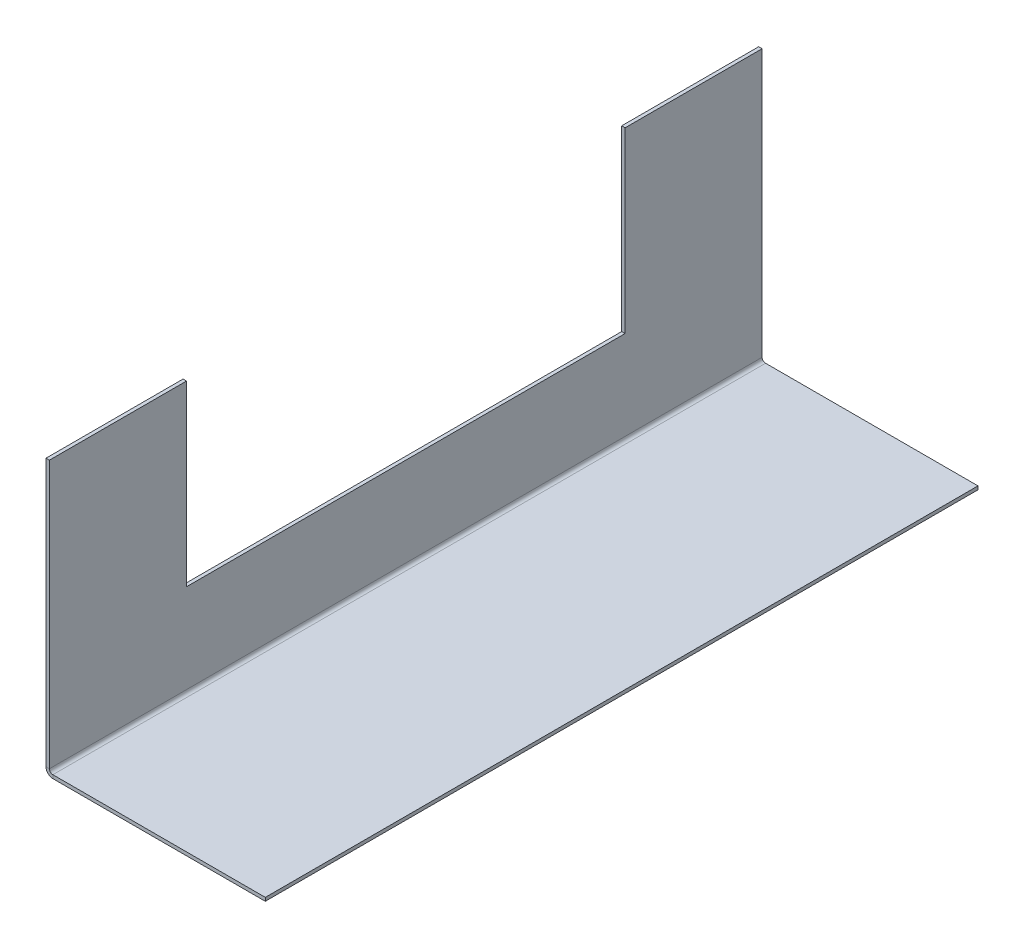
ISO-10303-21;
HEADER;
FILE_DESCRIPTION(('STEP AP214'),'2;1');
FILE_NAME('part.step','',(''),(''),'','','');
FILE_SCHEMA(('AUTOMOTIVE_DESIGN { 1 0 10303 214 1 1 1 1 }'));
ENDSEC;
DATA;
#1=APPLICATION_CONTEXT('core data for automotive mechanical design processes');
#2=APPLICATION_PROTOCOL_DEFINITION('international standard','automotive_design',2000,#1);
#3=PRODUCT_CONTEXT('',#1,'mechanical');
#4=PRODUCT('Part','Part','',(#3));
#5=PRODUCT_RELATED_PRODUCT_CATEGORY('part','',(#4));
#6=PRODUCT_DEFINITION_FORMATION('','',#4);
#7=PRODUCT_DEFINITION_CONTEXT('part definition',#1,'design');
#8=PRODUCT_DEFINITION('design','',#6,#7);
#9=PRODUCT_DEFINITION_SHAPE('','',#8);
#10=(LENGTH_UNIT() NAMED_UNIT(*) SI_UNIT(.MILLI.,.METRE.));
#11=(NAMED_UNIT(*) PLANE_ANGLE_UNIT() SI_UNIT($,.RADIAN.));
#12=(NAMED_UNIT(*) SI_UNIT($,.STERADIAN.) SOLID_ANGLE_UNIT());
#13=UNCERTAINTY_MEASURE_WITH_UNIT(LENGTH_MEASURE(1.E-05),#10,'distance_accuracy_value','');
#14=(GEOMETRIC_REPRESENTATION_CONTEXT(3) GLOBAL_UNCERTAINTY_ASSIGNED_CONTEXT((#13)) GLOBAL_UNIT_ASSIGNED_CONTEXT((#10,
#11,#12)) REPRESENTATION_CONTEXT('',''));
#15=CARTESIAN_POINT('',(0.,0.,0.));
#16=DIRECTION('',(0.,0.,1.));
#17=DIRECTION('',(1.,0.,0.));
#18=AXIS2_PLACEMENT_3D('',#15,#16,#17);
#19=CARTESIAN_POINT('',(3.175,254.,-330.2));
#20=DIRECTION('',(0.,1.,0.));
#21=DIRECTION('',(0.,0.,1.));
#22=AXIS2_PLACEMENT_3D('',#19,#20,#21);
#23=PLANE('',#22);
#24=DIRECTION('',(1.,0.,0.));
#25=VECTOR('',#24,1.);
#26=CARTESIAN_POINT('',(0.,254.,-203.2));
#27=LINE('',#26,#25);
#28=CARTESIAN_POINT('',(0.,254.,-203.2));
#29=VERTEX_POINT('',#28);
#30=CARTESIAN_POINT('',(3.175,254.,-203.2));
#31=VERTEX_POINT('',#30);
#32=EDGE_CURVE('E129',#29,#31,#27,.T.);
#33=ORIENTED_EDGE('',*,*,#32,.T.);
#34=DIRECTION('',(0.,0.,1.));
#35=VECTOR('',#34,1.);
#36=CARTESIAN_POINT('',(3.175,254.,-330.2));
#37=LINE('',#36,#35);
#38=CARTESIAN_POINT('',(3.175,254.,-330.2));
#39=VERTEX_POINT('',#38);
#40=EDGE_CURVE('E122',#39,#31,#37,.T.);
#41=ORIENTED_EDGE('',*,*,#40,.F.);
#42=DIRECTION('',(-1.,0.,0.));
#43=VECTOR('',#42,1.);
#44=CARTESIAN_POINT('',(3.175,254.,-330.2));
#45=LINE('',#44,#43);
#46=CARTESIAN_POINT('',(0.,254.,-330.2));
#47=VERTEX_POINT('',#46);
#48=EDGE_CURVE('E126',#39,#47,#45,.T.);
#49=ORIENTED_EDGE('',*,*,#48,.T.);
#50=DIRECTION('',(0.,0.,1.));
#51=VECTOR('',#50,1.);
#52=CARTESIAN_POINT('',(0.,254.,-330.2));
#53=LINE('',#52,#51);
#54=EDGE_CURVE('E182',#47,#29,#53,.T.);
#55=ORIENTED_EDGE('',*,*,#54,.T.);
#56=EDGE_LOOP('',(#33,#41,#49,#55));
#57=FACE_BOUND('',#56,.T.);
#58=ADVANCED_FACE('F40',(#57),#23,.T.);
#59=CARTESIAN_POINT('',(6.35,0.,-330.2));
#60=DIRECTION('',(0.,0.,-1.));
#61=DIRECTION('',(-1.,0.,0.));
#62=AXIS2_PLACEMENT_3D('',#59,#60,#61);
#63=PLANE('',#62);
#64=DIRECTION('',(0.,1.,0.));
#65=VECTOR('',#64,1.);
#66=CARTESIAN_POINT('',(6.35,0.,-330.2));
#67=LINE('',#66,#65);
#68=CARTESIAN_POINT('',(6.35,0.,-330.2));
#69=VERTEX_POINT('',#68);
#70=CARTESIAN_POINT('',(6.35,3.175,-330.2));
#71=VERTEX_POINT('',#70);
#72=EDGE_CURVE('E11',#69,#71,#67,.T.);
#73=ORIENTED_EDGE('',*,*,#72,.F.);
#74=CARTESIAN_POINT('',(6.35,6.35,-330.2));
#75=DIRECTION('',(0.,0.,-1.));
#76=DIRECTION('',(-1.,0.,0.));
#77=AXIS2_PLACEMENT_3D('',#74,#75,#76);
#78=CIRCLE('',#77,6.35);
#79=CARTESIAN_POINT('',(0.,6.35,-330.2));
#80=VERTEX_POINT('',#79);
#81=EDGE_CURVE('E151',#80,#69,#78,.F.);
#82=ORIENTED_EDGE('',*,*,#81,.F.);
#83=DIRECTION('',(-1.,0.,0.));
#84=VECTOR('',#83,1.);
#85=CARTESIAN_POINT('',(3.175,6.35,-330.2));
#86=LINE('',#85,#84);
#87=CARTESIAN_POINT('',(3.175,6.35,-330.2));
#88=VERTEX_POINT('',#87);
#89=EDGE_CURVE('E48',#88,#80,#86,.T.);
#90=ORIENTED_EDGE('',*,*,#89,.F.);
#91=CARTESIAN_POINT('',(6.35,6.35,-330.2));
#92=DIRECTION('',(0.,0.,-1.));
#93=DIRECTION('',(-1.,0.,0.));
#94=AXIS2_PLACEMENT_3D('',#91,#92,#93);
#95=CIRCLE('',#94,3.175);
#96=EDGE_CURVE('E144',#88,#71,#95,.F.);
#97=ORIENTED_EDGE('',*,*,#96,.T.);
#98=EDGE_LOOP('',(#73,#82,#90,#97));
#99=FACE_BOUND('',#98,.T.);
#100=ADVANCED_FACE('F42',(#99),#63,.T.);
#101=CARTESIAN_POINT('',(3.175,6.35,-330.2));
#102=DIRECTION('',(0.,0.,-1.));
#103=DIRECTION('',(-1.,0.,0.));
#104=AXIS2_PLACEMENT_3D('',#101,#102,#103);
#105=PLANE('',#104);
#106=DIRECTION('',(1.,0.,0.));
#107=VECTOR('',#106,1.);
#108=CARTESIAN_POINT('',(0.,0.,-330.2));
#109=LINE('',#108,#107);
#110=CARTESIAN_POINT('',(203.2,0.,-330.2));
#111=VERTEX_POINT('',#110);
#112=EDGE_CURVE('E206',#69,#111,#109,.T.);
#113=ORIENTED_EDGE('',*,*,#112,.F.);
#114=ORIENTED_EDGE('',*,*,#72,.T.);
#115=DIRECTION('',(1.,0.,0.));
#116=VECTOR('',#115,1.);
#117=CARTESIAN_POINT('',(0.,3.175,-330.2));
#118=LINE('',#117,#116);
#119=CARTESIAN_POINT('',(203.2,3.17499999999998,-330.2));
#120=VERTEX_POINT('',#119);
#121=EDGE_CURVE('E102',#71,#120,#118,.T.);
#122=ORIENTED_EDGE('',*,*,#121,.T.);
#123=DIRECTION('',(0.,1.,0.));
#124=VECTOR('',#123,1.);
#125=CARTESIAN_POINT('',(203.2,0.,-330.2));
#126=LINE('',#125,#124);
#127=EDGE_CURVE('E251',#111,#120,#126,.T.);
#128=ORIENTED_EDGE('',*,*,#127,.F.);
#129=EDGE_LOOP('',(#113,#114,#122,#128));
#130=FACE_BOUND('',#129,.T.);
#131=ADVANCED_FACE('F259',(#130),#105,.T.);
#132=CARTESIAN_POINT('',(0.,6.35,330.2));
#133=DIRECTION('',(0.,0.,1.));
#134=DIRECTION('',(1.,0.,0.));
#135=AXIS2_PLACEMENT_3D('',#132,#133,#134);
#136=PLANE('',#135);
#137=DIRECTION('',(1.,0.,0.));
#138=VECTOR('',#137,1.);
#139=CARTESIAN_POINT('',(0.,6.35,330.2));
#140=LINE('',#139,#138);
#141=CARTESIAN_POINT('',(0.,6.35,330.2));
#142=VERTEX_POINT('',#141);
#143=CARTESIAN_POINT('',(3.175,6.35,330.2));
#144=VERTEX_POINT('',#143);
#145=EDGE_CURVE('E195',#142,#144,#140,.T.);
#146=ORIENTED_EDGE('',*,*,#145,.F.);
#147=CARTESIAN_POINT('',(6.35,6.35,330.2));
#148=DIRECTION('',(0.,0.,-1.));
#149=DIRECTION('',(-1.,0.,0.));
#150=AXIS2_PLACEMENT_3D('',#147,#148,#149);
#151=CIRCLE('',#150,6.35);
#152=CARTESIAN_POINT('',(6.35,0.,330.2));
#153=VERTEX_POINT('',#152);
#154=EDGE_CURVE('E167',#142,#153,#151,.F.);
#155=ORIENTED_EDGE('',*,*,#154,.T.);
#156=DIRECTION('',(0.,-1.,0.));
#157=VECTOR('',#156,1.);
#158=CARTESIAN_POINT('',(6.35,3.175,330.2));
#159=LINE('',#158,#157);
#160=CARTESIAN_POINT('',(6.35,3.175,330.2));
#161=VERTEX_POINT('',#160);
#162=EDGE_CURVE('E96',#161,#153,#159,.T.);
#163=ORIENTED_EDGE('',*,*,#162,.F.);
#164=CARTESIAN_POINT('',(6.35,6.35,330.2));
#165=DIRECTION('',(0.,0.,-1.));
#166=DIRECTION('',(-1.,0.,0.));
#167=AXIS2_PLACEMENT_3D('',#164,#165,#166);
#168=CIRCLE('',#167,3.175);
#169=EDGE_CURVE('E177',#144,#161,#168,.F.);
#170=ORIENTED_EDGE('',*,*,#169,.F.);
#171=EDGE_LOOP('',(#146,#155,#163,#170));
#172=FACE_BOUND('',#171,.T.);
#173=ADVANCED_FACE('F265',(#172),#136,.T.);
#174=CARTESIAN_POINT('',(6.35,3.175,330.2));
#175=DIRECTION('',(0.,0.,1.));
#176=DIRECTION('',(1.,0.,0.));
#177=AXIS2_PLACEMENT_3D('',#174,#175,#176);
#178=PLANE('',#177);
#179=DIRECTION('',(0.,-1.,0.));
#180=VECTOR('',#179,1.);
#181=CARTESIAN_POINT('',(0.,0.,330.2));
#182=LINE('',#181,#180);
#183=CARTESIAN_POINT('',(0.,254.,330.2));
#184=VERTEX_POINT('',#183);
#185=EDGE_CURVE('E169',#184,#142,#182,.T.);
#186=ORIENTED_EDGE('',*,*,#185,.T.);
#187=ORIENTED_EDGE('',*,*,#145,.T.);
#188=DIRECTION('',(0.,1.,0.));
#189=VECTOR('',#188,1.);
#190=CARTESIAN_POINT('',(3.175,0.,330.2));
#191=LINE('',#190,#189);
#192=CARTESIAN_POINT('',(3.175,254.,330.2));
#193=VERTEX_POINT('',#192);
#194=EDGE_CURVE('E175',#193,#144,#191,.F.);
#195=ORIENTED_EDGE('',*,*,#194,.F.);
#196=DIRECTION('',(-1.,0.,0.));
#197=VECTOR('',#196,1.);
#198=CARTESIAN_POINT('',(3.175,254.,330.2));
#199=LINE('',#198,#197);
#200=EDGE_CURVE('E172',#193,#184,#199,.T.);
#201=ORIENTED_EDGE('',*,*,#200,.T.);
#202=EDGE_LOOP('',(#186,#187,#195,#201));
#203=FACE_BOUND('',#202,.T.);
#204=ADVANCED_FACE('F268',(#203),#178,.T.);
#205=CARTESIAN_POINT('',(0.,3.175,-330.2));
#206=DIRECTION('',(0.,-1.,0.));
#207=DIRECTION('',(1.,0.,0.));
#208=AXIS2_PLACEMENT_3D('',#205,#206,#207);
#209=PLANE('',#208);
#210=DIRECTION('',(1.,0.,0.));
#211=VECTOR('',#210,1.);
#212=CARTESIAN_POINT('',(0.,3.175,330.2));
#213=LINE('',#212,#211);
#214=CARTESIAN_POINT('',(203.2,3.17499999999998,330.2));
#215=VERTEX_POINT('',#214);
#216=EDGE_CURVE('E157',#161,#215,#213,.T.);
#217=ORIENTED_EDGE('',*,*,#216,.T.);
#218=DIRECTION('',(0.,0.,1.));
#219=VECTOR('',#218,1.);
#220=CARTESIAN_POINT('',(203.2,3.17499999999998,-330.2));
#221=LINE('',#220,#219);
#222=EDGE_CURVE('E192',#120,#215,#221,.T.);
#223=ORIENTED_EDGE('',*,*,#222,.F.);
#224=ORIENTED_EDGE('',*,*,#121,.F.);
#225=DIRECTION('',(0.,0.,1.));
#226=VECTOR('',#225,1.);
#227=CARTESIAN_POINT('',(6.35,3.175,-330.2));
#228=LINE('',#227,#226);
#229=EDGE_CURVE('E156',#71,#161,#228,.T.);
#230=ORIENTED_EDGE('',*,*,#229,.T.);
#231=EDGE_LOOP('',(#217,#223,#224,#230));
#232=FACE_BOUND('',#231,.T.);
#233=ADVANCED_FACE('F274',(#232),#209,.F.);
#234=CARTESIAN_POINT('',(203.2,0.,-330.2));
#235=DIRECTION('',(1.,0.,0.));
#236=DIRECTION('',(0.,0.,-1.));
#237=AXIS2_PLACEMENT_3D('',#234,#235,#236);
#238=PLANE('',#237);
#239=DIRECTION('',(0.,1.,0.));
#240=VECTOR('',#239,1.);
#241=CARTESIAN_POINT('',(203.2,0.,330.2));
#242=LINE('',#241,#240);
#243=CARTESIAN_POINT('',(203.2,0.,330.2));
#244=VERTEX_POINT('',#243);
#245=EDGE_CURVE('E160',#244,#215,#242,.T.);
#246=ORIENTED_EDGE('',*,*,#245,.F.);
#247=DIRECTION('',(0.,0.,1.));
#248=VECTOR('',#247,1.);
#249=CARTESIAN_POINT('',(203.2,0.,-330.2));
#250=LINE('',#249,#248);
#251=EDGE_CURVE('E190',#111,#244,#250,.T.);
#252=ORIENTED_EDGE('',*,*,#251,.F.);
#253=ORIENTED_EDGE('',*,*,#127,.T.);
#254=ORIENTED_EDGE('',*,*,#222,.T.);
#255=EDGE_LOOP('',(#246,#252,#253,#254));
#256=FACE_BOUND('',#255,.T.);
#257=ADVANCED_FACE('F261',(#256),#238,.T.);
#258=CARTESIAN_POINT('',(0.,0.,-330.2));
#259=DIRECTION('',(0.,-1.,0.));
#260=DIRECTION('',(1.,0.,0.));
#261=AXIS2_PLACEMENT_3D('',#258,#259,#260);
#262=PLANE('',#261);
#263=DIRECTION('',(1.,0.,0.));
#264=VECTOR('',#263,1.);
#265=CARTESIAN_POINT('',(0.,0.,330.2));
#266=LINE('',#265,#264);
#267=EDGE_CURVE('E164',#153,#244,#266,.T.);
#268=ORIENTED_EDGE('',*,*,#267,.F.);
#269=DIRECTION('',(0.,0.,1.));
#270=VECTOR('',#269,1.);
#271=CARTESIAN_POINT('',(6.35,0.,-330.2));
#272=LINE('',#271,#270);
#273=EDGE_CURVE('E187',#69,#153,#272,.T.);
#274=ORIENTED_EDGE('',*,*,#273,.F.);
#275=ORIENTED_EDGE('',*,*,#112,.T.);
#276=ORIENTED_EDGE('',*,*,#251,.T.);
#277=EDGE_LOOP('',(#268,#274,#275,#276));
#278=FACE_BOUND('',#277,.T.);
#279=ADVANCED_FACE('F257',(#278),#262,.T.);
#280=CARTESIAN_POINT('',(6.35,6.35,-330.2));
#281=DIRECTION('',(0.,0.,1.));
#282=DIRECTION('',(1.,0.,0.));
#283=AXIS2_PLACEMENT_3D('',#280,#281,#282);
#284=CYLINDRICAL_SURFACE('',#283,6.35);
#285=ORIENTED_EDGE('',*,*,#154,.F.);
#286=DIRECTION('',(0.,0.,1.));
#287=VECTOR('',#286,1.);
#288=CARTESIAN_POINT('',(0.,6.35,-330.2));
#289=LINE('',#288,#287);
#290=EDGE_CURVE('E184',#80,#142,#289,.T.);
#291=ORIENTED_EDGE('',*,*,#290,.F.);
#292=ORIENTED_EDGE('',*,*,#81,.T.);
#293=ORIENTED_EDGE('',*,*,#273,.T.);
#294=EDGE_LOOP('',(#285,#291,#292,#293));
#295=FACE_BOUND('',#294,.T.);
#296=ADVANCED_FACE('F202',(#295),#284,.T.);
#297=CARTESIAN_POINT('',(0.,0.,-330.2));
#298=DIRECTION('',(-1.,0.,0.));
#299=DIRECTION('',(0.,0.,1.));
#300=AXIS2_PLACEMENT_3D('',#297,#298,#299);
#301=PLANE('',#300);
#302=DIRECTION('',(0.,1.,0.));
#303=VECTOR('',#302,1.);
#304=CARTESIAN_POINT('',(0.,88.9,-203.2));
#305=LINE('',#304,#303);
#306=CARTESIAN_POINT('',(0.,88.9,-203.2));
#307=VERTEX_POINT('',#306);
#308=EDGE_CURVE('E212',#307,#29,#305,.T.);
#309=ORIENTED_EDGE('',*,*,#308,.T.);
#310=ORIENTED_EDGE('',*,*,#54,.F.);
#311=DIRECTION('',(0.,-1.,0.));
#312=VECTOR('',#311,1.);
#313=CARTESIAN_POINT('',(0.,0.,-330.2));
#314=LINE('',#313,#312);
#315=EDGE_CURVE('E149',#47,#80,#314,.T.);
#316=ORIENTED_EDGE('',*,*,#315,.T.);
#317=ORIENTED_EDGE('',*,*,#290,.T.);
#318=ORIENTED_EDGE('',*,*,#185,.F.);
#319=CARTESIAN_POINT('',(0.,254.,203.2));
#320=VERTEX_POINT('',#319);
#321=EDGE_CURVE('E132',#320,#184,#53,.T.);
#322=ORIENTED_EDGE('',*,*,#321,.F.);
#323=DIRECTION('',(0.,-1.,0.));
#324=VECTOR('',#323,1.);
#325=CARTESIAN_POINT('',(0.,88.9,203.2));
#326=LINE('',#325,#324);
#327=CARTESIAN_POINT('',(0.,88.9,203.2));
#328=VERTEX_POINT('',#327);
#329=EDGE_CURVE('E243',#320,#328,#326,.T.);
#330=ORIENTED_EDGE('',*,*,#329,.T.);
#331=DIRECTION('',(0.,0.,-1.));
#332=VECTOR('',#331,1.);
#333=CARTESIAN_POINT('',(0.,88.9,203.2));
#334=LINE('',#333,#332);
#335=EDGE_CURVE('E234',#328,#307,#334,.T.);
#336=ORIENTED_EDGE('',*,*,#335,.T.);
#337=EDGE_LOOP('',(#309,#310,#316,#317,#318,#322,#330,#336));
#338=FACE_BOUND('',#337,.T.);
#339=ADVANCED_FACE('F208',(#338),#301,.T.);
#340=DIRECTION('',(1.,0.,0.));
#341=VECTOR('',#340,1.);
#342=CARTESIAN_POINT('',(0.,254.,203.2));
#343=LINE('',#342,#341);
#344=CARTESIAN_POINT('',(3.175,254.,203.2));
#345=VERTEX_POINT('',#344);
#346=EDGE_CURVE('E55',#320,#345,#343,.T.);
#347=ORIENTED_EDGE('',*,*,#346,.F.);
#348=ORIENTED_EDGE('',*,*,#321,.T.);
#349=ORIENTED_EDGE('',*,*,#200,.F.);
#350=EDGE_CURVE('E133',#345,#193,#37,.T.);
#351=ORIENTED_EDGE('',*,*,#350,.F.);
#352=EDGE_LOOP('',(#347,#348,#349,#351));
#353=FACE_BOUND('',#352,.T.);
#354=ADVANCED_FACE('F285',(#353),#23,.T.);
#355=CARTESIAN_POINT('',(3.175,0.,-330.2));
#356=DIRECTION('',(-1.,0.,0.));
#357=DIRECTION('',(0.,0.,1.));
#358=AXIS2_PLACEMENT_3D('',#355,#356,#357);
#359=PLANE('',#358);
#360=ORIENTED_EDGE('',*,*,#40,.T.);
#361=DIRECTION('',(0.,1.,0.));
#362=VECTOR('',#361,1.);
#363=CARTESIAN_POINT('',(3.175,88.9,-203.2));
#364=LINE('',#363,#362);
#365=CARTESIAN_POINT('',(3.175,88.9,-203.2));
#366=VERTEX_POINT('',#365);
#367=EDGE_CURVE('E240',#366,#31,#364,.T.);
#368=ORIENTED_EDGE('',*,*,#367,.F.);
#369=DIRECTION('',(0.,0.,-1.));
#370=VECTOR('',#369,1.);
#371=CARTESIAN_POINT('',(3.175,88.9,203.2));
#372=LINE('',#371,#370);
#373=CARTESIAN_POINT('',(3.175,88.9,203.2));
#374=VERTEX_POINT('',#373);
#375=EDGE_CURVE('E233',#374,#366,#372,.T.);
#376=ORIENTED_EDGE('',*,*,#375,.F.);
#377=DIRECTION('',(0.,-1.,0.));
#378=VECTOR('',#377,1.);
#379=CARTESIAN_POINT('',(3.175,88.9,203.2));
#380=LINE('',#379,#378);
#381=EDGE_CURVE('E237',#345,#374,#380,.T.);
#382=ORIENTED_EDGE('',*,*,#381,.F.);
#383=ORIENTED_EDGE('',*,*,#350,.T.);
#384=ORIENTED_EDGE('',*,*,#194,.T.);
#385=DIRECTION('',(0.,0.,1.));
#386=VECTOR('',#385,1.);
#387=CARTESIAN_POINT('',(3.175,6.35,-330.2));
#388=LINE('',#387,#386);
#389=EDGE_CURVE('E141',#88,#144,#388,.T.);
#390=ORIENTED_EDGE('',*,*,#389,.F.);
#391=DIRECTION('',(0.,1.,0.));
#392=VECTOR('',#391,1.);
#393=CARTESIAN_POINT('',(3.175,0.,-330.2));
#394=LINE('',#393,#392);
#395=EDGE_CURVE('E137',#39,#88,#394,.F.);
#396=ORIENTED_EDGE('',*,*,#395,.F.);
#397=EDGE_LOOP('',(#360,#368,#376,#382,#383,#384,#390,#396));
#398=FACE_BOUND('',#397,.T.);
#399=ADVANCED_FACE('F138',(#398),#359,.F.);
#400=CARTESIAN_POINT('',(6.35,6.35,-330.2));
#401=DIRECTION('',(0.,0.,1.));
#402=DIRECTION('',(1.,0.,0.));
#403=AXIS2_PLACEMENT_3D('',#400,#401,#402);
#404=CYLINDRICAL_SURFACE('',#403,3.175);
#405=ORIENTED_EDGE('',*,*,#169,.T.);
#406=ORIENTED_EDGE('',*,*,#229,.F.);
#407=ORIENTED_EDGE('',*,*,#96,.F.);
#408=ORIENTED_EDGE('',*,*,#389,.T.);
#409=EDGE_LOOP('',(#405,#406,#407,#408));
#410=FACE_BOUND('',#409,.T.);
#411=ADVANCED_FACE('F271',(#410),#404,.F.);
#412=CARTESIAN_POINT('',(6.35,6.35,-330.2));
#413=DIRECTION('',(0.,0.,-1.));
#414=DIRECTION('',(-1.,0.,0.));
#415=AXIS2_PLACEMENT_3D('',#412,#413,#414);
#416=PLANE('',#415);
#417=ORIENTED_EDGE('',*,*,#395,.T.);
#418=ORIENTED_EDGE('',*,*,#89,.T.);
#419=ORIENTED_EDGE('',*,*,#315,.F.);
#420=ORIENTED_EDGE('',*,*,#48,.F.);
#421=EDGE_LOOP('',(#417,#418,#419,#420));
#422=FACE_BOUND('',#421,.T.);
#423=ADVANCED_FACE('F147',(#422),#416,.T.);
#424=CARTESIAN_POINT('',(6.35,6.35,330.2));
#425=DIRECTION('',(0.,0.,-1.));
#426=DIRECTION('',(-1.,0.,0.));
#427=AXIS2_PLACEMENT_3D('',#424,#425,#426);
#428=PLANE('',#427);
#429=ORIENTED_EDGE('',*,*,#216,.F.);
#430=ORIENTED_EDGE('',*,*,#162,.T.);
#431=ORIENTED_EDGE('',*,*,#267,.T.);
#432=ORIENTED_EDGE('',*,*,#245,.T.);
#433=EDGE_LOOP('',(#429,#430,#431,#432));
#434=FACE_BOUND('',#433,.T.);
#435=ADVANCED_FACE('F264',(#434),#428,.F.);
#436=CARTESIAN_POINT('',(0.,88.9,-203.2));
#437=DIRECTION('',(0.,0.,-1.));
#438=DIRECTION('',(-1.,0.,0.));
#439=AXIS2_PLACEMENT_3D('',#436,#437,#438);
#440=PLANE('',#439);
#441=ORIENTED_EDGE('',*,*,#367,.T.);
#442=ORIENTED_EDGE('',*,*,#32,.F.);
#443=ORIENTED_EDGE('',*,*,#308,.F.);
#444=DIRECTION('',(1.,0.,0.));
#445=VECTOR('',#444,1.);
#446=CARTESIAN_POINT('',(0.,88.9,-203.2));
#447=LINE('',#446,#445);
#448=EDGE_CURVE('E161',#307,#366,#447,.T.);
#449=ORIENTED_EDGE('',*,*,#448,.T.);
#450=EDGE_LOOP('',(#441,#442,#443,#449));
#451=FACE_BOUND('',#450,.T.);
#452=ADVANCED_FACE('F300',(#451),#440,.F.);
#453=CARTESIAN_POINT('',(0.,88.9,203.2));
#454=DIRECTION('',(0.,-1.,0.));
#455=DIRECTION('',(0.,0.,-1.));
#456=AXIS2_PLACEMENT_3D('',#453,#454,#455);
#457=PLANE('',#456);
#458=ORIENTED_EDGE('',*,*,#375,.T.);
#459=ORIENTED_EDGE('',*,*,#448,.F.);
#460=ORIENTED_EDGE('',*,*,#335,.F.);
#461=DIRECTION('',(1.,0.,0.));
#462=VECTOR('',#461,1.);
#463=CARTESIAN_POINT('',(0.,88.9,203.2));
#464=LINE('',#463,#462);
#465=EDGE_CURVE('E230',#328,#374,#464,.T.);
#466=ORIENTED_EDGE('',*,*,#465,.T.);
#467=EDGE_LOOP('',(#458,#459,#460,#466));
#468=FACE_BOUND('',#467,.T.);
#469=ADVANCED_FACE('F231',(#468),#457,.F.);
#470=CARTESIAN_POINT('',(0.,88.9,203.2));
#471=DIRECTION('',(0.,0.,1.));
#472=DIRECTION('',(0.,-1.,0.));
#473=AXIS2_PLACEMENT_3D('',#470,#471,#472);
#474=PLANE('',#473);
#475=ORIENTED_EDGE('',*,*,#381,.T.);
#476=ORIENTED_EDGE('',*,*,#465,.F.);
#477=ORIENTED_EDGE('',*,*,#329,.F.);
#478=ORIENTED_EDGE('',*,*,#346,.T.);
#479=EDGE_LOOP('',(#475,#476,#477,#478));
#480=FACE_BOUND('',#479,.T.);
#481=ADVANCED_FACE('F238',(#480),#474,.F.);
#482=CLOSED_SHELL('',(#58,#100,#131,#173,#204,#233,#257,#279,#296,#339,#354,#399,#411,#423,#435,
#452,#469,#481));
#483=MANIFOLD_SOLID_BREP('B2',#482);
#484=ADVANCED_BREP_SHAPE_REPRESENTATION('',(#18,#483),#14);
#485=SHAPE_DEFINITION_REPRESENTATION(#9,#484);
ENDSEC;
END-ISO-10303-21;
